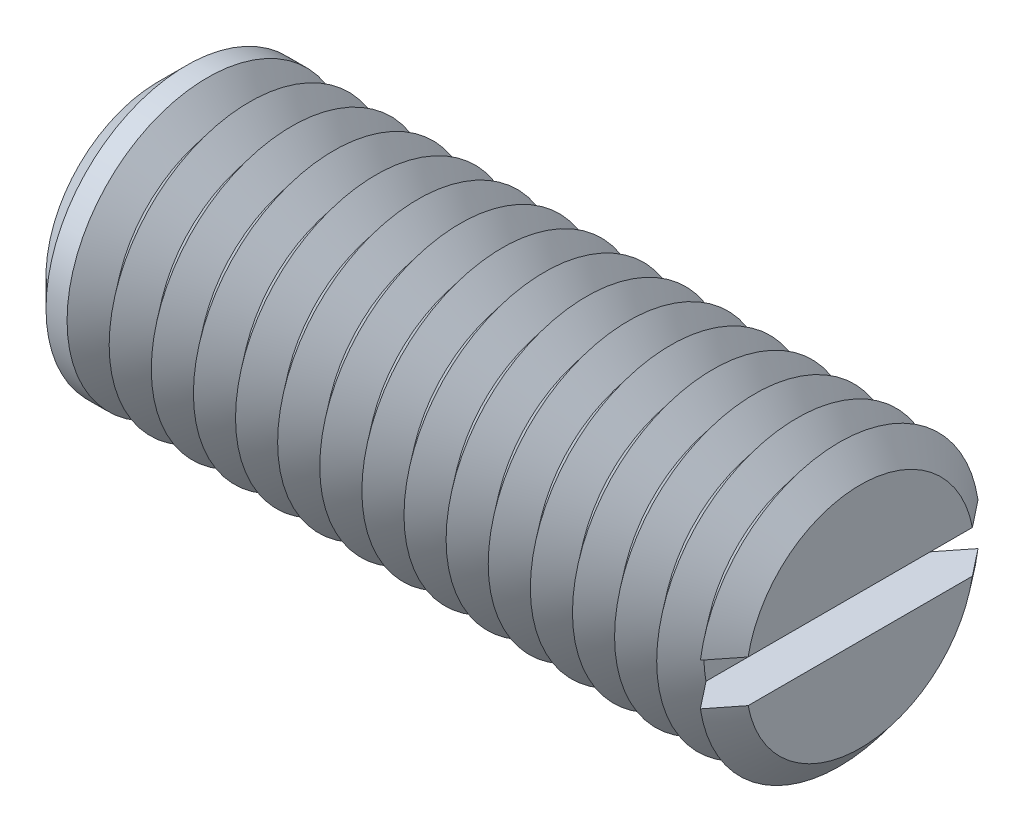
from build123d import *

# Parameters (mm, degrees)
SKETCH1_R       = 5
EXTRUDE1_DEPTH  = 12.5
SKETCH2_W       = 1.5
SKETCH2_H       = 1.5
EXTRUDE2_DEPTH  = 7.5
CHAMFER1_SIZE   = 1
LPATTERN1_COUNT = 16
LPATTERN1_PITCH = 1.5


with BuildPart() as part:
    # Sketch1 → Extrude1 (new, symmetric)
    with BuildSketch(Plane(origin=(0, 0, 0), x_dir=(0, 0, -1), z_dir=(1, 0, 0))):
        Circle(SKETCH1_R)
    extrude(amount=EXTRUDE1_DEPTH, both=True)

    # Sketch2 → Extrude2 (cut, symmetric)
    with BuildSketch(Plane.XY):
        with Locations((11.75, 0)):
            Rectangle(SKETCH2_W, SKETCH2_H)
    extrude(amount=EXTRUDE2_DEPTH, both=True, mode=Mode.SUBTRACT)

    # Chamfer1
    chamfer1_edges = [part.edges().sort_by_distance(p)[0] for p in [
        (-12.5, 0, 5),
    ]]
    chamfer(chamfer1_edges, length=CHAMFER1_SIZE)

    # Sketch3 → Cut-Revolve1 (revolve, cut)
    with BuildSketch(Plane.XY, mode=Mode.PRIVATE) as cut_revolve1_sk:
        Polygon((11.75, -5), (13.25, -5), (12.5, -4.0632503), align=None)
    cut_revolve1 = revolve(cut_revolve1_sk.sketch.rotate(Axis((0, 0, 0), (1, 0, 0)), 261.373073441), axis=Axis((0, 0, 0), (1, 0, 0)), mode=Mode.SUBTRACT)

    # LPattern1: Cut-Revolve1 ×16
    with Locations(*[(-i * LPATTERN1_PITCH, 0, 0) for i in range(1, LPATTERN1_COUNT)]):
        add(cut_revolve1, mode=Mode.SUBTRACT)


solid = part.part
